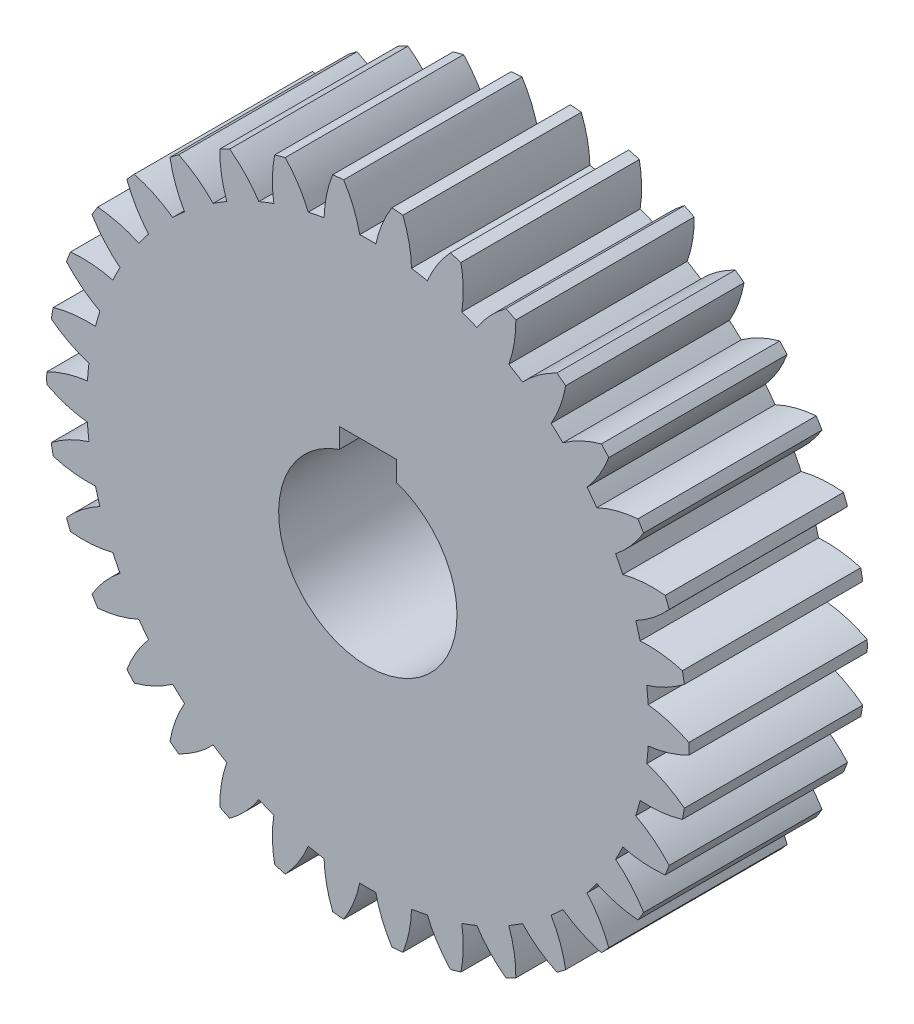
from build123d import *

# Parameters (mm, degrees)
SKETCH1_R           = 90
BOSS_EXTRUDE1_DEPTH = 50
CUT_EXTRUDE1_REACH  = 138.748
CIRPATTERN1_COUNT   = 34
CUT_EXTRUDE2_DEPTH  = 50


with BuildPart() as part:
    # Sketch1 → Boss-Extrude1 (new body)
    with BuildSketch(Plane.XY):
        Circle(SKETCH1_R)
    extrude(amount=BOSS_EXTRUDE1_DEPTH)

    # Sketch2 → Cut-Extrude1 (cut, up to next)
    with BuildSketch(Plane.XY.offset(50), mode=Mode.PRIVATE) as cut_extrude1_sk1:
        with BuildLine():
            ThreePointArc((2.254481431, 78.71672195), (0, 78.749), (-2.254481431, 78.71672195))
            ThreePointArc((-2.254481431, 78.71672195), (-4.023651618, 84.430205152), (-6.766641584, 89.745264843))
            ThreePointArc((-6.766641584, 89.745264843), (0, 90), (6.766641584, 89.745264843))
            ThreePointArc((6.766641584, 89.745264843), (4.023651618, 84.430205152), (2.254481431, 78.71672195))
        make_face()
    cut_extrude1_tool1 = extrude(cut_extrude1_sk1.sketch, amount=-CUT_EXTRUDE1_REACH, mode=Mode.PRIVATE) & part.part
    cut_extrude1 = cut_extrude1_tool1.solids().sort_by_distance((0, 85.348065, 50))[0]
    add(cut_extrude1, mode=Mode.SUBTRACT)

    # CirPattern1: Cut-Extrude1 ×34 about axis
    cirpattern1_axis = Axis((0, 0, 0), (0, 0, 1))
    for i in range(1, CIRPATTERN1_COUNT):
        add(cut_extrude1.rotate(cirpattern1_axis, i * 360 / CIRPATTERN1_COUNT), mode=Mode.SUBTRACT)

    # Sketch3 → Cut-Extrude2 (cut)
    with BuildSketch(Plane.XY.offset(50)):
        with BuildLine():
            Line((-8, 29.3), (8, 29.3))
            Line((8, 29.3), (8, 23.685438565))
            ThreePointArc((8, 23.685438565), (0, -25), (-8, 23.685438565))
            Line((-8, 23.685438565), (-8, 29.3))
        make_face()
    extrude(amount=-CUT_EXTRUDE2_DEPTH, mode=Mode.SUBTRACT)


solid = part.part
